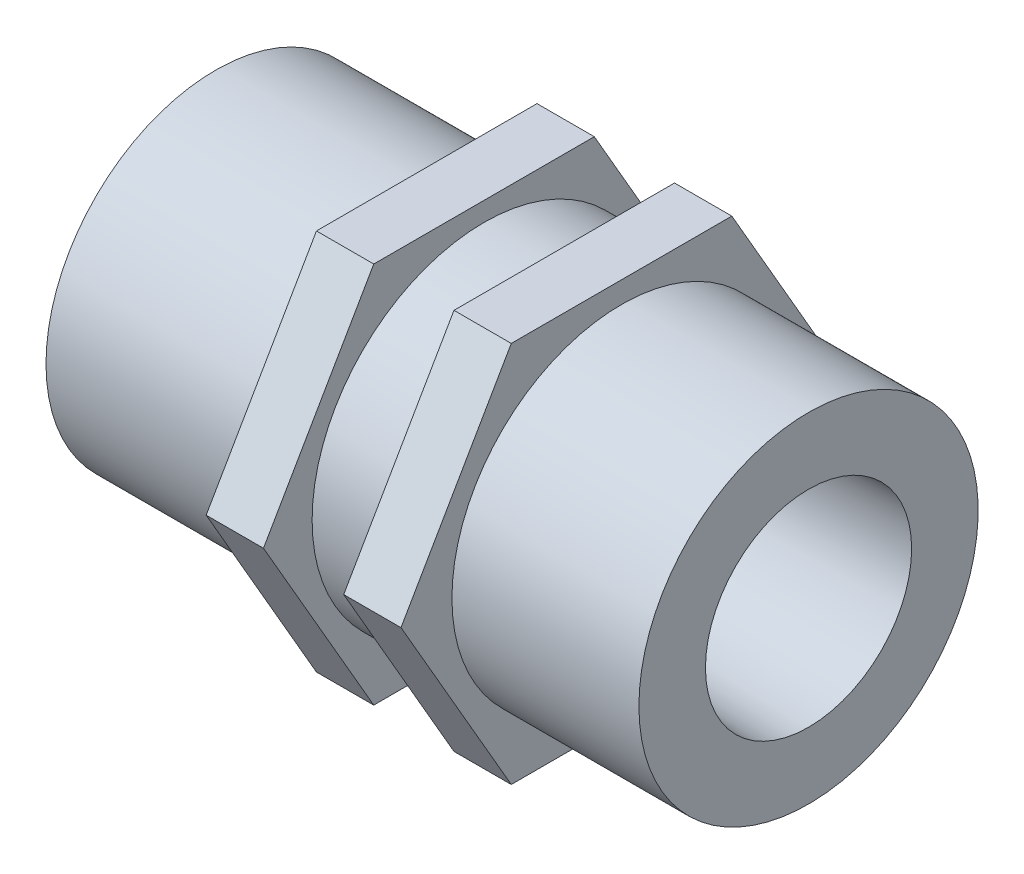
ISO-10303-21;
HEADER;
FILE_DESCRIPTION(('STEP AP214'),'2;1');
FILE_NAME('part.step','',(''),(''),'','','');
FILE_SCHEMA(('AUTOMOTIVE_DESIGN { 1 0 10303 214 1 1 1 1 }'));
ENDSEC;
DATA;
#1=APPLICATION_CONTEXT('core data for automotive mechanical design processes');
#2=APPLICATION_PROTOCOL_DEFINITION('international standard','automotive_design',2000,#1);
#3=PRODUCT_CONTEXT('',#1,'mechanical');
#4=PRODUCT('Part','Part','',(#3));
#5=PRODUCT_RELATED_PRODUCT_CATEGORY('part','',(#4));
#6=PRODUCT_DEFINITION_FORMATION('','',#4);
#7=PRODUCT_DEFINITION_CONTEXT('part definition',#1,'design');
#8=PRODUCT_DEFINITION('design','',#6,#7);
#9=PRODUCT_DEFINITION_SHAPE('','',#8);
#10=(LENGTH_UNIT() NAMED_UNIT(*) SI_UNIT(.MILLI.,.METRE.));
#11=(NAMED_UNIT(*) PLANE_ANGLE_UNIT() SI_UNIT($,.RADIAN.));
#12=(NAMED_UNIT(*) SI_UNIT($,.STERADIAN.) SOLID_ANGLE_UNIT());
#13=UNCERTAINTY_MEASURE_WITH_UNIT(LENGTH_MEASURE(1.E-05),#10,'distance_accuracy_value','');
#14=(GEOMETRIC_REPRESENTATION_CONTEXT(3) GLOBAL_UNCERTAINTY_ASSIGNED_CONTEXT((#13)) GLOBAL_UNIT_ASSIGNED_CONTEXT((#10,
#11,#12)) REPRESENTATION_CONTEXT('',''));
#15=CARTESIAN_POINT('',(0.,0.,0.));
#16=DIRECTION('',(0.,0.,1.));
#17=DIRECTION('',(1.,0.,0.));
#18=AXIS2_PLACEMENT_3D('',#15,#16,#17);
#19=CARTESIAN_POINT('',(26.924,0.,0.));
#20=DIRECTION('',(1.,0.,0.));
#21=DIRECTION('',(0.,0.,1.));
#22=AXIS2_PLACEMENT_3D('',#19,#20,#21);
#23=PLANE('',#22);
#24=DIRECTION('',(0.,0.866025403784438,-0.5));
#25=VECTOR('',#24,1.);
#26=CARTESIAN_POINT('',(26.924,0.,14.6646968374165));
#27=LINE('',#26,#25);
#28=CARTESIAN_POINT('',(26.924,0.,14.6646968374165));
#29=VERTEX_POINT('',#28);
#30=CARTESIAN_POINT('',(26.924,12.7,7.33234841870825));
#31=VERTEX_POINT('',#30);
#32=EDGE_CURVE('E192',#29,#31,#27,.T.);
#33=ORIENTED_EDGE('',*,*,#32,.F.);
#34=DIRECTION('',(0.,0.866025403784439,0.5));
#35=VECTOR('',#34,1.);
#36=CARTESIAN_POINT('',(26.924,-12.7,7.33234841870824));
#37=LINE('',#36,#35);
#38=CARTESIAN_POINT('',(26.924,-12.7,7.33234841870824));
#39=VERTEX_POINT('',#38);
#40=EDGE_CURVE('E220',#39,#29,#37,.T.);
#41=ORIENTED_EDGE('',*,*,#40,.F.);
#42=DIRECTION('',(0.,0.,1.));
#43=VECTOR('',#42,1.);
#44=CARTESIAN_POINT('',(26.924,-12.7,-7.33234841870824));
#45=LINE('',#44,#43);
#46=CARTESIAN_POINT('',(26.924,-12.7,-7.33234841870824));
#47=VERTEX_POINT('',#46);
#48=EDGE_CURVE('E217',#47,#39,#45,.T.);
#49=ORIENTED_EDGE('',*,*,#48,.F.);
#50=DIRECTION('',(0.,-0.866025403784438,0.5));
#51=VECTOR('',#50,1.);
#52=CARTESIAN_POINT('',(26.924,0.,-14.6646968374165));
#53=LINE('',#52,#51);
#54=CARTESIAN_POINT('',(26.924,0.,-14.6646968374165));
#55=VERTEX_POINT('',#54);
#56=EDGE_CURVE('E214',#55,#47,#53,.T.);
#57=ORIENTED_EDGE('',*,*,#56,.F.);
#58=DIRECTION('',(0.,-0.866025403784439,-0.5));
#59=VECTOR('',#58,1.);
#60=CARTESIAN_POINT('',(26.924,12.7,-7.33234841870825));
#61=LINE('',#60,#59);
#62=CARTESIAN_POINT('',(26.924,12.7,-7.33234841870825));
#63=VERTEX_POINT('',#62);
#64=EDGE_CURVE('E211',#63,#55,#61,.T.);
#65=ORIENTED_EDGE('',*,*,#64,.F.);
#66=DIRECTION('',(0.,0.,-1.));
#67=VECTOR('',#66,1.);
#68=CARTESIAN_POINT('',(26.924,12.7,7.33234841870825));
#69=LINE('',#68,#67);
#70=EDGE_CURVE('E188',#31,#63,#69,.T.);
#71=ORIENTED_EDGE('',*,*,#70,.F.);
#72=EDGE_LOOP('',(#33,#41,#49,#57,#65,#71));
#73=FACE_BOUND('',#72,.T.);
#74=CARTESIAN_POINT('',(26.924,0.,0.));
#75=DIRECTION('',(-1.,0.,0.));
#76=DIRECTION('',(0.,0.,1.));
#77=AXIS2_PLACEMENT_3D('',#74,#75,#76);
#78=CIRCLE('',#77,11.2785995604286);
#79=CARTESIAN_POINT('',(26.924,0.,11.2785995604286));
#80=VERTEX_POINT('',#79);
#81=EDGE_CURVE('E230',#80,#80,#78,.T.);
#82=ORIENTED_EDGE('',*,*,#81,.T.);
#83=EDGE_LOOP('',(#82));
#84=FACE_BOUND('',#83,.T.);
#85=ADVANCED_FACE('F43',(#73,#84),#23,.T.);
#86=CARTESIAN_POINT('',(13.97,0.,0.));
#87=DIRECTION('',(-1.,0.,0.));
#88=DIRECTION('',(0.,0.,1.));
#89=AXIS2_PLACEMENT_3D('',#86,#87,#88);
#90=PLANE('',#89);
#91=DIRECTION('',(0.,-0.866025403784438,0.5));
#92=VECTOR('',#91,1.);
#93=CARTESIAN_POINT('',(13.97,0.,-14.6646968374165));
#94=LINE('',#93,#92);
#95=CARTESIAN_POINT('',(13.97,0.,-14.6646968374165));
#96=VERTEX_POINT('',#95);
#97=CARTESIAN_POINT('',(13.97,-12.7,-7.33234841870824));
#98=VERTEX_POINT('',#97);
#99=EDGE_CURVE('E108',#96,#98,#94,.T.);
#100=ORIENTED_EDGE('',*,*,#99,.T.);
#101=DIRECTION('',(0.,0.,1.));
#102=VECTOR('',#101,1.);
#103=CARTESIAN_POINT('',(13.97,-12.7,-7.33234841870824));
#104=LINE('',#103,#102);
#105=CARTESIAN_POINT('',(13.97,-12.7,7.33234841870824));
#106=VERTEX_POINT('',#105);
#107=EDGE_CURVE('E113',#98,#106,#104,.T.);
#108=ORIENTED_EDGE('',*,*,#107,.T.);
#109=DIRECTION('',(0.,0.866025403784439,0.5));
#110=VECTOR('',#109,1.);
#111=CARTESIAN_POINT('',(13.97,-12.7,7.33234841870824));
#112=LINE('',#111,#110);
#113=CARTESIAN_POINT('',(13.97,0.,14.6646968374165));
#114=VERTEX_POINT('',#113);
#115=EDGE_CURVE('E61',#106,#114,#112,.T.);
#116=ORIENTED_EDGE('',*,*,#115,.T.);
#117=DIRECTION('',(0.,0.866025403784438,-0.5));
#118=VECTOR('',#117,1.);
#119=CARTESIAN_POINT('',(13.97,0.,14.6646968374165));
#120=LINE('',#119,#118);
#121=CARTESIAN_POINT('',(13.97,12.7,7.33234841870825));
#122=VERTEX_POINT('',#121);
#123=EDGE_CURVE('E97',#114,#122,#120,.T.);
#124=ORIENTED_EDGE('',*,*,#123,.T.);
#125=DIRECTION('',(0.,0.,-1.));
#126=VECTOR('',#125,1.);
#127=CARTESIAN_POINT('',(13.97,12.7,7.33234841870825));
#128=LINE('',#127,#126);
#129=CARTESIAN_POINT('',(13.97,12.7,-7.33234841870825));
#130=VERTEX_POINT('',#129);
#131=EDGE_CURVE('E155',#122,#130,#128,.T.);
#132=ORIENTED_EDGE('',*,*,#131,.T.);
#133=DIRECTION('',(0.,-0.866025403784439,-0.5));
#134=VECTOR('',#133,1.);
#135=CARTESIAN_POINT('',(13.97,12.7,-7.33234841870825));
#136=LINE('',#135,#134);
#137=EDGE_CURVE('E115',#130,#96,#136,.T.);
#138=ORIENTED_EDGE('',*,*,#137,.T.);
#139=EDGE_LOOP('',(#100,#108,#116,#124,#132,#138));
#140=FACE_BOUND('',#139,.T.);
#141=CARTESIAN_POINT('',(13.97,0.,0.));
#142=DIRECTION('',(-1.,0.,0.));
#143=DIRECTION('',(0.,0.,1.));
#144=AXIS2_PLACEMENT_3D('',#141,#142,#143);
#145=CIRCLE('',#144,11.2785995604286);
#146=CARTESIAN_POINT('',(13.97,0.,11.2785995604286));
#147=VERTEX_POINT('',#146);
#148=EDGE_CURVE('E208',#147,#147,#145,.T.);
#149=ORIENTED_EDGE('',*,*,#148,.F.);
#150=EDGE_LOOP('',(#149));
#151=FACE_BOUND('',#150,.T.);
#152=ADVANCED_FACE('F110',(#140,#151),#90,.T.);
#153=CARTESIAN_POINT('',(0.,0.,0.));
#154=DIRECTION('',(-1.,0.,0.));
#155=DIRECTION('',(0.,0.,1.));
#156=AXIS2_PLACEMENT_3D('',#153,#154,#155);
#157=CYLINDRICAL_SURFACE('',#156,11.43);
#158=CARTESIAN_POINT('',(17.7799999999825,0.,0.));
#159=DIRECTION('',(-1.,0.,0.));
#160=DIRECTION('',(0.,0.,1.));
#161=AXIS2_PLACEMENT_3D('',#158,#159,#160);
#162=CIRCLE('',#161,11.43);
#163=CARTESIAN_POINT('',(17.7799999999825,0.,11.43));
#164=VERTEX_POINT('',#163);
#165=EDGE_CURVE('E13',#164,#164,#162,.T.);
#166=ORIENTED_EDGE('',*,*,#165,.F.);
#167=EDGE_LOOP('',(#166));
#168=FACE_BOUND('',#167,.T.);
#169=CARTESIAN_POINT('',(23.114,0.,0.));
#170=DIRECTION('',(1.,0.,0.));
#171=DIRECTION('',(0.,1.,0.));
#172=AXIS2_PLACEMENT_3D('',#169,#170,#171);
#173=CIRCLE('',#172,11.43);
#174=CARTESIAN_POINT('',(23.114,11.43,0.));
#175=VERTEX_POINT('',#174);
#176=EDGE_CURVE('E137',#175,#175,#173,.T.);
#177=ORIENTED_EDGE('',*,*,#176,.F.);
#178=EDGE_LOOP('',(#177));
#179=FACE_BOUND('',#178,.T.);
#180=ADVANCED_FACE('F45',(#168,#179),#157,.T.);
#181=CARTESIAN_POINT('',(17.78,0.,0.));
#182=DIRECTION('',(-1.,0.,0.));
#183=DIRECTION('',(0.,0.,1.));
#184=AXIS2_PLACEMENT_3D('',#181,#182,#183);
#185=PLANE('',#184);
#186=DIRECTION('',(0.,0.866025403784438,-0.5));
#187=VECTOR('',#186,1.);
#188=CARTESIAN_POINT('',(17.78,0.,14.6646968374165));
#189=LINE('',#188,#187);
#190=CARTESIAN_POINT('',(17.78,0.,14.6646968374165));
#191=VERTEX_POINT('',#190);
#192=CARTESIAN_POINT('',(17.78,12.7,7.33234841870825));
#193=VERTEX_POINT('',#192);
#194=EDGE_CURVE('E133',#191,#193,#189,.T.);
#195=ORIENTED_EDGE('',*,*,#194,.F.);
#196=DIRECTION('',(0.,0.866025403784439,0.5));
#197=VECTOR('',#196,1.);
#198=CARTESIAN_POINT('',(17.78,-12.7,7.33234841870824));
#199=LINE('',#198,#197);
#200=CARTESIAN_POINT('',(17.78,-12.7,7.33234841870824));
#201=VERTEX_POINT('',#200);
#202=EDGE_CURVE('E91',#201,#191,#199,.T.);
#203=ORIENTED_EDGE('',*,*,#202,.F.);
#204=DIRECTION('',(0.,0.,1.));
#205=VECTOR('',#204,1.);
#206=CARTESIAN_POINT('',(17.78,-12.7,-7.33234841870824));
#207=LINE('',#206,#205);
#208=CARTESIAN_POINT('',(17.78,-12.7,-7.33234841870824));
#209=VERTEX_POINT('',#208);
#210=EDGE_CURVE('E85',#209,#201,#207,.T.);
#211=ORIENTED_EDGE('',*,*,#210,.F.);
#212=DIRECTION('',(0.,-0.866025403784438,0.5));
#213=VECTOR('',#212,1.);
#214=CARTESIAN_POINT('',(17.78,0.,-14.6646968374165));
#215=LINE('',#214,#213);
#216=CARTESIAN_POINT('',(17.78,0.,-14.6646968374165));
#217=VERTEX_POINT('',#216);
#218=EDGE_CURVE('E123',#217,#209,#215,.T.);
#219=ORIENTED_EDGE('',*,*,#218,.F.);
#220=DIRECTION('',(0.,-0.866025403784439,-0.5));
#221=VECTOR('',#220,1.);
#222=CARTESIAN_POINT('',(17.78,12.7,-7.33234841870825));
#223=LINE('',#222,#221);
#224=CARTESIAN_POINT('',(17.78,12.7,-7.33234841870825));
#225=VERTEX_POINT('',#224);
#226=EDGE_CURVE('E139',#225,#217,#223,.T.);
#227=ORIENTED_EDGE('',*,*,#226,.F.);
#228=DIRECTION('',(0.,0.,-1.));
#229=VECTOR('',#228,1.);
#230=CARTESIAN_POINT('',(17.78,12.7,7.33234841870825));
#231=LINE('',#230,#229);
#232=EDGE_CURVE('E136',#193,#225,#231,.T.);
#233=ORIENTED_EDGE('',*,*,#232,.F.);
#234=EDGE_LOOP('',(#195,#203,#211,#219,#227,#233));
#235=FACE_BOUND('',#234,.T.);
#236=ORIENTED_EDGE('',*,*,#165,.T.);
#237=EDGE_LOOP('',(#236));
#238=FACE_BOUND('',#237,.T.);
#239=ADVANCED_FACE('F160',(#235,#238),#185,.F.);
#240=CARTESIAN_POINT('',(13.97,0.,14.6646968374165));
#241=DIRECTION('',(0.,-0.5,-0.866025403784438));
#242=DIRECTION('',(0.,0.866025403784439,-0.5));
#243=AXIS2_PLACEMENT_3D('',#240,#241,#242);
#244=PLANE('',#243);
#245=ORIENTED_EDGE('',*,*,#194,.T.);
#246=DIRECTION('',(1.,0.,0.));
#247=VECTOR('',#246,1.);
#248=CARTESIAN_POINT('',(13.97,12.7,7.33234841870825));
#249=LINE('',#248,#247);
#250=EDGE_CURVE('E53',#122,#193,#249,.T.);
#251=ORIENTED_EDGE('',*,*,#250,.F.);
#252=ORIENTED_EDGE('',*,*,#123,.F.);
#253=DIRECTION('',(1.,0.,0.));
#254=VECTOR('',#253,1.);
#255=CARTESIAN_POINT('',(13.97,0.,14.6646968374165));
#256=LINE('',#255,#254);
#257=EDGE_CURVE('E129',#114,#191,#256,.T.);
#258=ORIENTED_EDGE('',*,*,#257,.T.);
#259=EDGE_LOOP('',(#245,#251,#252,#258));
#260=FACE_BOUND('',#259,.T.);
#261=ADVANCED_FACE('F158',(#260),#244,.F.);
#262=CARTESIAN_POINT('',(13.97,12.7,7.33234841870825));
#263=DIRECTION('',(0.,-1.,0.));
#264=DIRECTION('',(0.,0.,-1.));
#265=AXIS2_PLACEMENT_3D('',#262,#263,#264);
#266=PLANE('',#265);
#267=ORIENTED_EDGE('',*,*,#232,.T.);
#268=DIRECTION('',(1.,0.,0.));
#269=VECTOR('',#268,1.);
#270=CARTESIAN_POINT('',(13.97,12.7,-7.33234841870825));
#271=LINE('',#270,#269);
#272=EDGE_CURVE('E147',#130,#225,#271,.T.);
#273=ORIENTED_EDGE('',*,*,#272,.F.);
#274=ORIENTED_EDGE('',*,*,#131,.F.);
#275=ORIENTED_EDGE('',*,*,#250,.T.);
#276=EDGE_LOOP('',(#267,#273,#274,#275));
#277=FACE_BOUND('',#276,.T.);
#278=ADVANCED_FACE('F153',(#277),#266,.F.);
#279=CARTESIAN_POINT('',(13.97,12.7,-7.33234841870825));
#280=DIRECTION('',(0.,-0.5,0.866025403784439));
#281=DIRECTION('',(0.,-0.866025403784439,-0.5));
#282=AXIS2_PLACEMENT_3D('',#279,#280,#281);
#283=PLANE('',#282);
#284=ORIENTED_EDGE('',*,*,#226,.T.);
#285=DIRECTION('',(1.,0.,0.));
#286=VECTOR('',#285,1.);
#287=CARTESIAN_POINT('',(13.97,0.,-14.6646968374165));
#288=LINE('',#287,#286);
#289=EDGE_CURVE('E124',#96,#217,#288,.T.);
#290=ORIENTED_EDGE('',*,*,#289,.F.);
#291=ORIENTED_EDGE('',*,*,#137,.F.);
#292=ORIENTED_EDGE('',*,*,#272,.T.);
#293=EDGE_LOOP('',(#284,#290,#291,#292));
#294=FACE_BOUND('',#293,.T.);
#295=ADVANCED_FACE('F164',(#294),#283,.F.);
#296=CARTESIAN_POINT('',(13.97,0.,-14.6646968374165));
#297=DIRECTION('',(0.,0.5,0.866025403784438));
#298=DIRECTION('',(0.,-0.866025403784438,0.5));
#299=AXIS2_PLACEMENT_3D('',#296,#297,#298);
#300=PLANE('',#299);
#301=ORIENTED_EDGE('',*,*,#218,.T.);
#302=DIRECTION('',(1.,0.,0.));
#303=VECTOR('',#302,1.);
#304=CARTESIAN_POINT('',(13.97,-12.7,-7.33234841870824));
#305=LINE('',#304,#303);
#306=EDGE_CURVE('E120',#98,#209,#305,.T.);
#307=ORIENTED_EDGE('',*,*,#306,.F.);
#308=ORIENTED_EDGE('',*,*,#99,.F.);
#309=ORIENTED_EDGE('',*,*,#289,.T.);
#310=EDGE_LOOP('',(#301,#307,#308,#309));
#311=FACE_BOUND('',#310,.T.);
#312=ADVANCED_FACE('F121',(#311),#300,.F.);
#313=CARTESIAN_POINT('',(13.97,-12.7,-7.33234841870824));
#314=DIRECTION('',(0.,1.,0.));
#315=DIRECTION('',(-1.,0.,0.));
#316=AXIS2_PLACEMENT_3D('',#313,#314,#315);
#317=PLANE('',#316);
#318=ORIENTED_EDGE('',*,*,#210,.T.);
#319=DIRECTION('',(1.,0.,0.));
#320=VECTOR('',#319,1.);
#321=CARTESIAN_POINT('',(13.97,-12.7,7.33234841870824));
#322=LINE('',#321,#320);
#323=EDGE_CURVE('E125',#106,#201,#322,.T.);
#324=ORIENTED_EDGE('',*,*,#323,.F.);
#325=ORIENTED_EDGE('',*,*,#107,.F.);
#326=ORIENTED_EDGE('',*,*,#306,.T.);
#327=EDGE_LOOP('',(#318,#324,#325,#326));
#328=FACE_BOUND('',#327,.T.);
#329=ADVANCED_FACE('F127',(#328),#317,.F.);
#330=CARTESIAN_POINT('',(13.97,-12.7,7.33234841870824));
#331=DIRECTION('',(0.,0.5,-0.866025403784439));
#332=DIRECTION('',(0.,0.866025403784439,0.5));
#333=AXIS2_PLACEMENT_3D('',#330,#331,#332);
#334=PLANE('',#333);
#335=ORIENTED_EDGE('',*,*,#202,.T.);
#336=ORIENTED_EDGE('',*,*,#257,.F.);
#337=ORIENTED_EDGE('',*,*,#115,.F.);
#338=ORIENTED_EDGE('',*,*,#323,.T.);
#339=EDGE_LOOP('',(#335,#336,#337,#338));
#340=FACE_BOUND('',#339,.T.);
#341=ADVANCED_FACE('F297',(#340),#334,.F.);
#342=CARTESIAN_POINT('',(23.114,0.,0.));
#343=DIRECTION('',(1.,0.,0.));
#344=DIRECTION('',(0.,0.,1.));
#345=AXIS2_PLACEMENT_3D('',#342,#343,#344);
#346=PLANE('',#345);
#347=DIRECTION('',(0.,0.866025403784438,-0.5));
#348=VECTOR('',#347,1.);
#349=CARTESIAN_POINT('',(23.114,0.,14.6646968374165));
#350=LINE('',#349,#348);
#351=CARTESIAN_POINT('',(23.114,0.,14.6646968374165));
#352=VERTEX_POINT('',#351);
#353=CARTESIAN_POINT('',(23.114,12.7,7.33234841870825));
#354=VERTEX_POINT('',#353);
#355=EDGE_CURVE('E205',#352,#354,#350,.T.);
#356=ORIENTED_EDGE('',*,*,#355,.T.);
#357=DIRECTION('',(0.,0.,-1.));
#358=VECTOR('',#357,1.);
#359=CARTESIAN_POINT('',(23.114,12.7,7.33234841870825));
#360=LINE('',#359,#358);
#361=CARTESIAN_POINT('',(23.114,12.7,-7.33234841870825));
#362=VERTEX_POINT('',#361);
#363=EDGE_CURVE('E189',#354,#362,#360,.T.);
#364=ORIENTED_EDGE('',*,*,#363,.T.);
#365=DIRECTION('',(0.,-0.866025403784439,-0.5));
#366=VECTOR('',#365,1.);
#367=CARTESIAN_POINT('',(23.114,12.7,-7.33234841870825));
#368=LINE('',#367,#366);
#369=CARTESIAN_POINT('',(23.114,0.,-14.6646968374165));
#370=VERTEX_POINT('',#369);
#371=EDGE_CURVE('E193',#362,#370,#368,.T.);
#372=ORIENTED_EDGE('',*,*,#371,.T.);
#373=DIRECTION('',(0.,-0.866025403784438,0.5));
#374=VECTOR('',#373,1.);
#375=CARTESIAN_POINT('',(23.114,0.,-14.6646968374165));
#376=LINE('',#375,#374);
#377=CARTESIAN_POINT('',(23.114,-12.7,-7.33234841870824));
#378=VERTEX_POINT('',#377);
#379=EDGE_CURVE('E196',#370,#378,#376,.T.);
#380=ORIENTED_EDGE('',*,*,#379,.T.);
#381=DIRECTION('',(0.,0.,1.));
#382=VECTOR('',#381,1.);
#383=CARTESIAN_POINT('',(23.114,-12.7,-7.33234841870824));
#384=LINE('',#383,#382);
#385=CARTESIAN_POINT('',(23.114,-12.7,7.33234841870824));
#386=VERTEX_POINT('',#385);
#387=EDGE_CURVE('E199',#378,#386,#384,.T.);
#388=ORIENTED_EDGE('',*,*,#387,.T.);
#389=DIRECTION('',(0.,0.866025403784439,0.5));
#390=VECTOR('',#389,1.);
#391=CARTESIAN_POINT('',(23.114,-12.7,7.33234841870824));
#392=LINE('',#391,#390);
#393=EDGE_CURVE('E202',#386,#352,#392,.T.);
#394=ORIENTED_EDGE('',*,*,#393,.T.);
#395=EDGE_LOOP('',(#356,#364,#372,#380,#388,#394));
#396=FACE_BOUND('',#395,.T.);
#397=ORIENTED_EDGE('',*,*,#176,.T.);
#398=EDGE_LOOP('',(#397));
#399=FACE_BOUND('',#398,.T.);
#400=ADVANCED_FACE('F293',(#396,#399),#346,.F.);
#401=CARTESIAN_POINT('',(26.924,0.,14.6646968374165));
#402=DIRECTION('',(0.,0.5,0.866025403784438));
#403=DIRECTION('',(0.,-0.866025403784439,0.5));
#404=AXIS2_PLACEMENT_3D('',#401,#402,#403);
#405=PLANE('',#404);
#406=ORIENTED_EDGE('',*,*,#355,.F.);
#407=DIRECTION('',(-1.,0.,0.));
#408=VECTOR('',#407,1.);
#409=CARTESIAN_POINT('',(26.924,0.,14.6646968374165));
#410=LINE('',#409,#408);
#411=EDGE_CURVE('E170',#29,#352,#410,.T.);
#412=ORIENTED_EDGE('',*,*,#411,.F.);
#413=ORIENTED_EDGE('',*,*,#32,.T.);
#414=DIRECTION('',(-1.,0.,0.));
#415=VECTOR('',#414,1.);
#416=CARTESIAN_POINT('',(26.924,12.7,7.33234841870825));
#417=LINE('',#416,#415);
#418=EDGE_CURVE('E185',#31,#354,#417,.T.);
#419=ORIENTED_EDGE('',*,*,#418,.T.);
#420=EDGE_LOOP('',(#406,#412,#413,#419));
#421=FACE_BOUND('',#420,.T.);
#422=ADVANCED_FACE('F296',(#421),#405,.T.);
#423=CARTESIAN_POINT('',(26.924,-12.7,7.33234841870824));
#424=DIRECTION('',(0.,-0.5,0.866025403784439));
#425=DIRECTION('',(0.,-0.866025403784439,-0.5));
#426=AXIS2_PLACEMENT_3D('',#423,#424,#425);
#427=PLANE('',#426);
#428=ORIENTED_EDGE('',*,*,#393,.F.);
#429=DIRECTION('',(-1.,0.,0.));
#430=VECTOR('',#429,1.);
#431=CARTESIAN_POINT('',(26.924,-12.7,7.33234841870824));
#432=LINE('',#431,#430);
#433=EDGE_CURVE('E173',#39,#386,#432,.T.);
#434=ORIENTED_EDGE('',*,*,#433,.F.);
#435=ORIENTED_EDGE('',*,*,#40,.T.);
#436=ORIENTED_EDGE('',*,*,#411,.T.);
#437=EDGE_LOOP('',(#428,#434,#435,#436));
#438=FACE_BOUND('',#437,.T.);
#439=ADVANCED_FACE('F314',(#438),#427,.T.);
#440=CARTESIAN_POINT('',(26.924,-12.7,-7.33234841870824));
#441=DIRECTION('',(0.,-1.,0.));
#442=DIRECTION('',(1.,0.,0.));
#443=AXIS2_PLACEMENT_3D('',#440,#441,#442);
#444=PLANE('',#443);
#445=ORIENTED_EDGE('',*,*,#387,.F.);
#446=DIRECTION('',(-1.,0.,0.));
#447=VECTOR('',#446,1.);
#448=CARTESIAN_POINT('',(26.924,-12.7,-7.33234841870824));
#449=LINE('',#448,#447);
#450=EDGE_CURVE('E176',#47,#378,#449,.T.);
#451=ORIENTED_EDGE('',*,*,#450,.F.);
#452=ORIENTED_EDGE('',*,*,#48,.T.);
#453=ORIENTED_EDGE('',*,*,#433,.T.);
#454=EDGE_LOOP('',(#445,#451,#452,#453));
#455=FACE_BOUND('',#454,.T.);
#456=ADVANCED_FACE('F310',(#455),#444,.T.);
#457=CARTESIAN_POINT('',(26.924,0.,-14.6646968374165));
#458=DIRECTION('',(0.,-0.5,-0.866025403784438));
#459=DIRECTION('',(0.,0.866025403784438,-0.5));
#460=AXIS2_PLACEMENT_3D('',#457,#458,#459);
#461=PLANE('',#460);
#462=ORIENTED_EDGE('',*,*,#379,.F.);
#463=DIRECTION('',(-1.,0.,0.));
#464=VECTOR('',#463,1.);
#465=CARTESIAN_POINT('',(26.924,0.,-14.6646968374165));
#466=LINE('',#465,#464);
#467=EDGE_CURVE('E179',#55,#370,#466,.T.);
#468=ORIENTED_EDGE('',*,*,#467,.F.);
#469=ORIENTED_EDGE('',*,*,#56,.T.);
#470=ORIENTED_EDGE('',*,*,#450,.T.);
#471=EDGE_LOOP('',(#462,#468,#469,#470));
#472=FACE_BOUND('',#471,.T.);
#473=ADVANCED_FACE('F306',(#472),#461,.T.);
#474=CARTESIAN_POINT('',(26.924,12.7,-7.33234841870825));
#475=DIRECTION('',(0.,0.5,-0.866025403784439));
#476=DIRECTION('',(0.,0.866025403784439,0.5));
#477=AXIS2_PLACEMENT_3D('',#474,#475,#476);
#478=PLANE('',#477);
#479=ORIENTED_EDGE('',*,*,#371,.F.);
#480=DIRECTION('',(-1.,0.,0.));
#481=VECTOR('',#480,1.);
#482=CARTESIAN_POINT('',(26.924,12.7,-7.33234841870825));
#483=LINE('',#482,#481);
#484=EDGE_CURVE('E182',#63,#362,#483,.T.);
#485=ORIENTED_EDGE('',*,*,#484,.F.);
#486=ORIENTED_EDGE('',*,*,#64,.T.);
#487=ORIENTED_EDGE('',*,*,#467,.T.);
#488=EDGE_LOOP('',(#479,#485,#486,#487));
#489=FACE_BOUND('',#488,.T.);
#490=ADVANCED_FACE('F302',(#489),#478,.T.);
#491=CARTESIAN_POINT('',(26.924,12.7,7.33234841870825));
#492=DIRECTION('',(0.,1.,0.));
#493=DIRECTION('',(0.,0.,1.));
#494=AXIS2_PLACEMENT_3D('',#491,#492,#493);
#495=PLANE('',#494);
#496=ORIENTED_EDGE('',*,*,#363,.F.);
#497=ORIENTED_EDGE('',*,*,#418,.F.);
#498=ORIENTED_EDGE('',*,*,#70,.T.);
#499=ORIENTED_EDGE('',*,*,#484,.T.);
#500=EDGE_LOOP('',(#496,#497,#498,#499));
#501=FACE_BOUND('',#500,.T.);
#502=ADVANCED_FACE('F299',(#501),#495,.T.);
#503=CARTESIAN_POINT('',(0.,0.,0.));
#504=DIRECTION('',(-1.,0.,0.));
#505=DIRECTION('',(0.,0.,1.));
#506=AXIS2_PLACEMENT_3D('',#503,#504,#505);
#507=CYLINDRICAL_SURFACE('',#506,11.2785995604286);
#508=CARTESIAN_POINT('',(-0.0660422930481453,0.,0.));
#509=DIRECTION('',(-1.,0.,0.));
#510=DIRECTION('',(0.,0.,1.));
#511=AXIS2_PLACEMENT_3D('',#508,#509,#510);
#512=CIRCLE('',#511,11.2785995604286);
#513=CARTESIAN_POINT('',(-0.0660422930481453,0.,11.2785995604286));
#514=VERTEX_POINT('',#513);
#515=EDGE_CURVE('E227',#514,#514,#512,.T.);
#516=ORIENTED_EDGE('',*,*,#515,.F.);
#517=EDGE_LOOP('',(#516));
#518=FACE_BOUND('',#517,.T.);
#519=ORIENTED_EDGE('',*,*,#148,.T.);
#520=EDGE_LOOP('',(#519));
#521=FACE_BOUND('',#520,.T.);
#522=ADVANCED_FACE('F278',(#518,#521),#507,.T.);
#523=CARTESIAN_POINT('',(-0.0660422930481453,11.2785995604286,0.));
#524=DIRECTION('',(1.,0.,0.));
#525=DIRECTION('',(0.,0.,-1.));
#526=AXIS2_PLACEMENT_3D('',#523,#524,#525);
#527=PLANE('',#526);
#528=CARTESIAN_POINT('',(-0.066042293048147,0.,0.));
#529=DIRECTION('',(-1.,0.,0.));
#530=DIRECTION('',(0.,0.,1.));
#531=AXIS2_PLACEMENT_3D('',#528,#529,#530);
#532=CIRCLE('',#531,6.8545837);
#533=CARTESIAN_POINT('',(-0.066042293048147,0.,6.8545837));
#534=VERTEX_POINT('',#533);
#535=EDGE_CURVE('E245',#534,#534,#532,.T.);
#536=ORIENTED_EDGE('',*,*,#535,.F.);
#537=EDGE_LOOP('',(#536));
#538=FACE_BOUND('',#537,.T.);
#539=ORIENTED_EDGE('',*,*,#515,.T.);
#540=EDGE_LOOP('',(#539));
#541=FACE_BOUND('',#540,.T.);
#542=ADVANCED_FACE('F272',(#538,#541),#527,.F.);
#543=CARTESIAN_POINT('',(0.,0.,0.));
#544=DIRECTION('',(-1.,0.,0.));
#545=DIRECTION('',(0.,0.,1.));
#546=AXIS2_PLACEMENT_3D('',#543,#544,#545);
#547=CYLINDRICAL_SURFACE('',#546,11.2785995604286);
#548=ORIENTED_EDGE('',*,*,#81,.F.);
#549=EDGE_LOOP('',(#548));
#550=FACE_BOUND('',#549,.T.);
#551=CARTESIAN_POINT('',(39.3572648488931,0.,0.));
#552=DIRECTION('',(-1.,0.,0.));
#553=DIRECTION('',(0.,0.,1.));
#554=AXIS2_PLACEMENT_3D('',#551,#552,#553);
#555=CIRCLE('',#554,11.2785995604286);
#556=CARTESIAN_POINT('',(39.3572648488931,0.,11.2785995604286));
#557=VERTEX_POINT('',#556);
#558=EDGE_CURVE('E233',#557,#557,#555,.T.);
#559=ORIENTED_EDGE('',*,*,#558,.T.);
#560=EDGE_LOOP('',(#559));
#561=FACE_BOUND('',#560,.T.);
#562=ADVANCED_FACE('F267',(#550,#561),#547,.T.);
#563=CARTESIAN_POINT('',(39.3572648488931,11.2785995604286,0.));
#564=DIRECTION('',(-1.,0.,0.));
#565=DIRECTION('',(0.,0.,1.));
#566=AXIS2_PLACEMENT_3D('',#563,#564,#565);
#567=PLANE('',#566);
#568=CARTESIAN_POINT('',(39.3572648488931,0.,0.));
#569=DIRECTION('',(1.,0.,0.));
#570=DIRECTION('',(0.,0.,-1.));
#571=AXIS2_PLACEMENT_3D('',#568,#569,#570);
#572=CIRCLE('',#571,6.8545837);
#573=CARTESIAN_POINT('',(39.3572648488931,0.,-6.8545837));
#574=VERTEX_POINT('',#573);
#575=EDGE_CURVE('E257',#574,#574,#572,.T.);
#576=ORIENTED_EDGE('',*,*,#575,.F.);
#577=EDGE_LOOP('',(#576));
#578=FACE_BOUND('',#577,.T.);
#579=ORIENTED_EDGE('',*,*,#558,.F.);
#580=EDGE_LOOP('',(#579));
#581=FACE_BOUND('',#580,.T.);
#582=ADVANCED_FACE('F263',(#578,#581),#567,.F.);
#583=CARTESIAN_POINT('',(16.9519577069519,0.,0.));
#584=DIRECTION('',(-1.,0.,0.));
#585=DIRECTION('',(0.,0.,1.));
#586=AXIS2_PLACEMENT_3D('',#583,#584,#585);
#587=CONICAL_SURFACE('',#586,5.5626,1.02974425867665);
#588=CARTESIAN_POINT('',(19.6456112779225,0.,0.));
#589=DIRECTION('',(1.,0.,0.));
#590=DIRECTION('',(0.,0.,-1.));
#591=AXIS2_PLACEMENT_3D('',#588,#589,#590);
#592=CIRCLE('',#591,1.07960762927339);
#593=CARTESIAN_POINT('',(19.6456112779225,0.,1.07960762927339));
#594=VERTEX_POINT('',#593);
#595=EDGE_CURVE('E47',#594,#594,#592,.T.);
#596=CARTESIAN_POINT('',(16.9519577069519,0.,0.));
#597=DIRECTION('',(-1.,0.,0.));
#598=DIRECTION('',(0.,0.,1.));
#599=AXIS2_PLACEMENT_3D('',#596,#597,#598);
#600=CIRCLE('',#599,5.5626);
#601=CARTESIAN_POINT('',(16.9519577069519,0.,5.5626));
#602=VERTEX_POINT('',#601);
#603=EDGE_CURVE('E236',#602,#602,#600,.T.);
#604=CARTESIAN_POINT('',(19.6456112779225,0.,1.07960762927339));
#605=CARTESIAN_POINT('',(19.6175523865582,0.,1.12630546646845));
#606=CARTESIAN_POINT('',(19.5894934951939,0.,1.17300330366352));
#607=CARTESIAN_POINT('',(19.5333757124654,0.,1.26639897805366));
#608=CARTESIAN_POINT('',(19.5053168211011,0.,1.31309681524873));
#609=CARTESIAN_POINT('',(19.4491990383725,0.,1.40649248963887));
#610=CARTESIAN_POINT('',(19.4211401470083,0.,1.45319032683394));
#611=CARTESIAN_POINT('',(19.3650223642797,0.,1.54658600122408));
#612=CARTESIAN_POINT('',(19.3369634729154,0.,1.59328383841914));
#613=CARTESIAN_POINT('',(19.2808456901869,0.,1.68667951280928));
#614=CARTESIAN_POINT('',(19.2527867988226,0.,1.73337735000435));
#615=CARTESIAN_POINT('',(19.196669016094,0.,1.82677302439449));
#616=CARTESIAN_POINT('',(19.1686101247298,0.,1.87347086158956));
#617=CARTESIAN_POINT('',(19.1124923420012,0.,1.9668665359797));
#618=CARTESIAN_POINT('',(19.0844334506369,0.,2.01356437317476));
#619=CARTESIAN_POINT('',(19.0283156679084,0.,2.1069600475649));
#620=CARTESIAN_POINT('',(19.0002567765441,0.,2.15365788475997));
#621=CARTESIAN_POINT('',(18.9441389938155,0.,2.24705355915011));
#622=CARTESIAN_POINT('',(18.9160801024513,0.,2.29375139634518));
#623=CARTESIAN_POINT('',(18.8599623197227,0.,2.38714707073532));
#624=CARTESIAN_POINT('',(18.8319034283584,0.,2.43384490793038));
#625=CARTESIAN_POINT('',(18.7757856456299,0.,2.52724058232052));
#626=CARTESIAN_POINT('',(18.7477267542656,0.,2.57393841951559));
#627=CARTESIAN_POINT('',(18.6916089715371,0.,2.66733409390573));
#628=CARTESIAN_POINT('',(18.6635500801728,0.,2.7140319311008));
#629=CARTESIAN_POINT('',(18.6074322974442,0.,2.80742760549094));
#630=CARTESIAN_POINT('',(18.5793734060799,0.,2.854125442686));
#631=CARTESIAN_POINT('',(18.5232556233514,0.,2.94752111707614));
#632=CARTESIAN_POINT('',(18.4951967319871,0.,2.99421895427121));
#633=CARTESIAN_POINT('',(18.4390789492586,0.,3.08761462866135));
#634=CARTESIAN_POINT('',(18.4110200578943,0.,3.13431246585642));
#635=CARTESIAN_POINT('',(18.3549022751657,0.,3.22770814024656));
#636=CARTESIAN_POINT('',(18.3268433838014,0.,3.27440597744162));
#637=CARTESIAN_POINT('',(18.2707256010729,0.,3.36780165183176));
#638=CARTESIAN_POINT('',(18.2426667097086,0.,3.41449948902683));
#639=CARTESIAN_POINT('',(18.1865489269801,0.,3.50789516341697));
#640=CARTESIAN_POINT('',(18.1584900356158,0.,3.55459300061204));
#641=CARTESIAN_POINT('',(18.1023722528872,0.,3.64798867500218));
#642=CARTESIAN_POINT('',(18.074313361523,0.,3.69468651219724));
#643=CARTESIAN_POINT('',(18.0181955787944,0.,3.78808218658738));
#644=CARTESIAN_POINT('',(17.9901366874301,0.,3.83478002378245));
#645=CARTESIAN_POINT('',(17.9340189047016,0.,3.92817569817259));
#646=CARTESIAN_POINT('',(17.9059600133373,0.,3.97487353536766));
#647=CARTESIAN_POINT('',(17.8498422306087,0.,4.0682692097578));
#648=CARTESIAN_POINT('',(17.8217833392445,0.,4.11496704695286));
#649=CARTESIAN_POINT('',(17.7656655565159,0.,4.208362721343));
#650=CARTESIAN_POINT('',(17.7376066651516,0.,4.25506055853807));
#651=CARTESIAN_POINT('',(17.6814888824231,0.,4.34845623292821));
#652=CARTESIAN_POINT('',(17.6534299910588,0.,4.39515407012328));
#653=CARTESIAN_POINT('',(17.5973122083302,0.,4.48854974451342));
#654=CARTESIAN_POINT('',(17.569253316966,0.,4.53524758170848));
#655=CARTESIAN_POINT('',(17.5131355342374,0.,4.62864325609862));
#656=CARTESIAN_POINT('',(17.4850766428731,0.,4.67534109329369));
#657=CARTESIAN_POINT('',(17.4289588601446,0.,4.76873676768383));
#658=CARTESIAN_POINT('',(17.4008999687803,0.,4.8154346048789));
#659=CARTESIAN_POINT('',(17.3447821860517,0.,4.90883027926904));
#660=CARTESIAN_POINT('',(17.3167232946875,0.,4.95552811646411));
#661=CARTESIAN_POINT('',(17.2606055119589,0.,5.04892379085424));
#662=CARTESIAN_POINT('',(17.2325466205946,0.,5.09562162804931));
#663=CARTESIAN_POINT('',(17.1764288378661,0.,5.18901730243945));
#664=CARTESIAN_POINT('',(17.1483699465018,0.,5.23571513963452));
#665=CARTESIAN_POINT('',(17.0922521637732,0.,5.32911081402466));
#666=CARTESIAN_POINT('',(17.064193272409,0.,5.37580865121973));
#667=CARTESIAN_POINT('',(17.0080754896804,0.,5.46920432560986));
#668=CARTESIAN_POINT('',(16.9800165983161,0.,5.51590216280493));
#669=CARTESIAN_POINT('',(16.9519577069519,0.,5.5626));
#670=B_SPLINE_CURVE_WITH_KNOTS('',3,(#604,#605,#606,#607,#608,#609,#610,#611,#612,#613,#614,
#615,#616,#617,#618,#619,#620,#621,#622,#623,#624,#625,#626,#627,#628,#629,#630,#631,#632,#633,
#634,#635,#636,#637,#638,#639,#640,#641,#642,#643,#644,#645,#646,#647,#648,#649,#650,#651,#652,
#653,#654,#655,#656,#657,#658,#659,#660,#661,#662,#663,#664,#665,#666,#667,#668,#669),
.UNSPECIFIED.,.F.,.F.,(4,2,2,2,2,2,2,2,2,2,2,2,2,2,2,2,2,2,2,2,2,2,2,2,2,2,2,2,2,2,2,2,4),(0.,
0.163437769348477,0.326875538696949,0.490313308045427,0.653751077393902,0.817188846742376,
0.980626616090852,1.14406438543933,1.3075021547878,1.47093992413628,1.63437769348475,
1.79781546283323,1.9612532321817,2.12469100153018,2.28812877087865,2.45156654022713,
2.6150043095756,2.77844207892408,2.94187984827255,3.10531761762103,3.2687553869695,
3.43219315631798,3.59563092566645,3.75906869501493,3.9225064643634,4.08594423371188,
4.24938200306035,4.41281977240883,4.5762575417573,4.73969531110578,4.90313308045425,
5.06657084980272,5.2300086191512),.UNSPECIFIED.);
#671=EDGE_CURVE('BSEAM266',#594,#602,#670,.T.);
#672=ORIENTED_EDGE('',*,*,#595,.T.);
#673=ORIENTED_EDGE('',*,*,#603,.T.);
#674=ORIENTED_EDGE('',*,*,#671,.T.);
#675=ORIENTED_EDGE('',*,*,#671,.F.);
#676=EDGE_LOOP('',(#672,#674,#673,#675));
#677=FACE_BOUND('',#676,.T.);
#678=ADVANCED_FACE('F266',(#677),#587,.F.);
#679=CARTESIAN_POINT('',(-0.0660422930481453,0.,0.));
#680=DIRECTION('',(-1.,0.,0.));
#681=DIRECTION('',(0.,0.,1.));
#682=AXIS2_PLACEMENT_3D('',#679,#680,#681);
#683=CYLINDRICAL_SURFACE('',#682,5.5626);
#684=ORIENTED_EDGE('',*,*,#603,.F.);
#685=EDGE_LOOP('',(#684));
#686=FACE_BOUND('',#685,.T.);
#687=CARTESIAN_POINT('',(9.83995770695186,0.,0.));
#688=DIRECTION('',(-1.,0.,0.));
#689=DIRECTION('',(0.,0.,1.));
#690=AXIS2_PLACEMENT_3D('',#687,#688,#689);
#691=CIRCLE('',#690,5.5626);
#692=CARTESIAN_POINT('',(9.83995770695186,0.,5.5626));
#693=VERTEX_POINT('',#692);
#694=EDGE_CURVE('E239',#693,#693,#691,.T.);
#695=ORIENTED_EDGE('',*,*,#694,.T.);
#696=EDGE_LOOP('',(#695));
#697=FACE_BOUND('',#696,.T.);
#698=ADVANCED_FACE('F405',(#686,#697),#683,.F.);
#699=CARTESIAN_POINT('',(9.83995770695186,5.5626,0.));
#700=DIRECTION('',(1.,0.,0.));
#701=DIRECTION('',(0.,0.,-1.));
#702=AXIS2_PLACEMENT_3D('',#699,#700,#701);
#703=PLANE('',#702);
#704=ORIENTED_EDGE('',*,*,#694,.F.);
#705=EDGE_LOOP('',(#704));
#706=FACE_BOUND('',#705,.T.);
#707=CARTESIAN_POINT('',(9.83995770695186,0.,0.));
#708=DIRECTION('',(-1.,0.,0.));
#709=DIRECTION('',(0.,0.,1.));
#710=AXIS2_PLACEMENT_3D('',#707,#708,#709);
#711=CIRCLE('',#710,6.55798479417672);
#712=CARTESIAN_POINT('',(9.83995770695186,0.,6.55798479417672));
#713=VERTEX_POINT('',#712);
#714=EDGE_CURVE('E242',#713,#713,#711,.T.);
#715=ORIENTED_EDGE('',*,*,#714,.T.);
#716=EDGE_LOOP('',(#715));
#717=FACE_BOUND('',#716,.T.);
#718=ADVANCED_FACE('F410',(#706,#717),#703,.F.);
#719=CARTESIAN_POINT('',(-0.066042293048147,0.,0.));
#720=DIRECTION('',(-1.,0.,0.));
#721=DIRECTION('',(0.,0.,1.));
#722=AXIS2_PLACEMENT_3D('',#719,#720,#721);
#723=CONICAL_SURFACE('',#722,6.8545837,0.0299323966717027);
#724=ORIENTED_EDGE('',*,*,#714,.F.);
#725=EDGE_LOOP('',(#724));
#726=FACE_BOUND('',#725,.T.);
#727=ORIENTED_EDGE('',*,*,#535,.T.);
#728=EDGE_LOOP('',(#727));
#729=FACE_BOUND('',#728,.T.);
#730=ADVANCED_FACE('F422',(#726,#729),#723,.F.);
#731=CARTESIAN_POINT('',(22.3392648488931,0.,0.));
#732=DIRECTION('',(1.,0.,0.));
#733=DIRECTION('',(0.,0.,-1.));
#734=AXIS2_PLACEMENT_3D('',#731,#732,#733);
#735=CONICAL_SURFACE('',#734,5.5626,1.02974425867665);
#736=CARTESIAN_POINT('',(22.3392648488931,0.,0.));
#737=DIRECTION('',(1.,0.,0.));
#738=DIRECTION('',(0.,0.,-1.));
#739=AXIS2_PLACEMENT_3D('',#736,#737,#738);
#740=CIRCLE('',#739,5.5626);
#741=CARTESIAN_POINT('',(22.3392648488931,0.,-5.5626));
#742=VERTEX_POINT('',#741);
#743=EDGE_CURVE('E248',#742,#742,#740,.T.);
#744=ORIENTED_EDGE('',*,*,#743,.T.);
#745=EDGE_LOOP('',(#744));
#746=FACE_BOUND('',#745,.T.);
#747=ORIENTED_EDGE('',*,*,#595,.F.);
#748=EDGE_LOOP('',(#747));
#749=FACE_BOUND('',#748,.T.);
#750=ADVANCED_FACE('F432',(#746,#749),#735,.F.);
#751=CARTESIAN_POINT('',(39.3572648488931,0.,0.));
#752=DIRECTION('',(1.,0.,0.));
#753=DIRECTION('',(0.,0.,-1.));
#754=AXIS2_PLACEMENT_3D('',#751,#752,#753);
#755=CYLINDRICAL_SURFACE('',#754,5.56260000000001);
#756=ORIENTED_EDGE('',*,*,#743,.F.);
#757=EDGE_LOOP('',(#756));
#758=FACE_BOUND('',#757,.T.);
#759=CARTESIAN_POINT('',(29.4512648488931,0.,0.));
#760=DIRECTION('',(1.,0.,0.));
#761=DIRECTION('',(0.,0.,-1.));
#762=AXIS2_PLACEMENT_3D('',#759,#760,#761);
#763=CIRCLE('',#762,5.56260000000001);
#764=CARTESIAN_POINT('',(29.4512648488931,0.,-5.56260000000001));
#765=VERTEX_POINT('',#764);
#766=EDGE_CURVE('E251',#765,#765,#763,.T.);
#767=ORIENTED_EDGE('',*,*,#766,.T.);
#768=EDGE_LOOP('',(#767));
#769=FACE_BOUND('',#768,.T.);
#770=ADVANCED_FACE('F455',(#758,#769),#755,.F.);
#771=CARTESIAN_POINT('',(29.4512648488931,5.56260000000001,0.));
#772=DIRECTION('',(-1.,0.,0.));
#773=DIRECTION('',(0.,0.,1.));
#774=AXIS2_PLACEMENT_3D('',#771,#772,#773);
#775=PLANE('',#774);
#776=ORIENTED_EDGE('',*,*,#766,.F.);
#777=EDGE_LOOP('',(#776));
#778=FACE_BOUND('',#777,.T.);
#779=CARTESIAN_POINT('',(29.4512648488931,0.,0.));
#780=DIRECTION('',(1.,0.,0.));
#781=DIRECTION('',(0.,0.,-1.));
#782=AXIS2_PLACEMENT_3D('',#779,#780,#781);
#783=CIRCLE('',#782,6.55798479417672);
#784=CARTESIAN_POINT('',(29.4512648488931,0.,-6.55798479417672));
#785=VERTEX_POINT('',#784);
#786=EDGE_CURVE('E254',#785,#785,#783,.T.);
#787=ORIENTED_EDGE('',*,*,#786,.T.);
#788=EDGE_LOOP('',(#787));
#789=FACE_BOUND('',#788,.T.);
#790=ADVANCED_FACE('F465',(#778,#789),#775,.F.);
#791=CARTESIAN_POINT('',(39.3572648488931,0.,0.));
#792=DIRECTION('',(1.,0.,0.));
#793=DIRECTION('',(0.,0.,-1.));
#794=AXIS2_PLACEMENT_3D('',#791,#792,#793);
#795=CONICAL_SURFACE('',#794,6.8545837,0.0299323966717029);
#796=ORIENTED_EDGE('',*,*,#786,.F.);
#797=EDGE_LOOP('',(#796));
#798=FACE_BOUND('',#797,.T.);
#799=ORIENTED_EDGE('',*,*,#575,.T.);
#800=EDGE_LOOP('',(#799));
#801=FACE_BOUND('',#800,.T.);
#802=ADVANCED_FACE('F261',(#798,#801),#795,.F.);
#803=CLOSED_SHELL('',(#85,#152,#180,#239,#261,#278,#295,#312,#329,#341,#400,#422,#439,#456,#473,
#490,#502,#522,#542,#562,#582,#678,#698,#718,#730,#750,#770,#790,#802));
#804=MANIFOLD_SOLID_BREP('B2',#803);
#805=ADVANCED_BREP_SHAPE_REPRESENTATION('',(#18,#804),#14);
#806=SHAPE_DEFINITION_REPRESENTATION(#9,#805);
ENDSEC;
END-ISO-10303-21;
